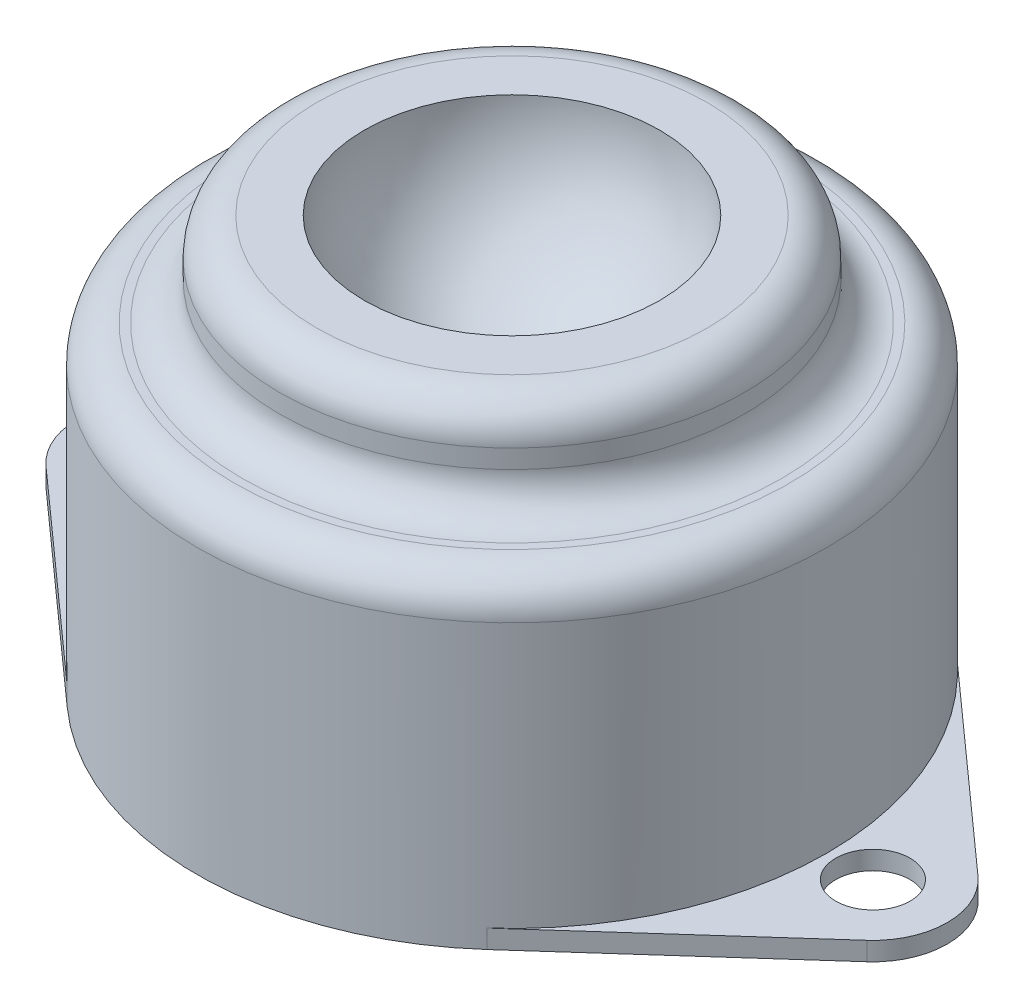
from build123d import *
from build123d.topology import SkipClean

# Parameters (mm, degrees)
SKETCH1_R           = 2
SKETCH1_R_2         = 16.933333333
BOSS_EXTRUDE1_DEPTH = 1
SKETCH2_R           = 16.933333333
BOSS_EXTRUDE2_DEPTH = 21.225
CUT_REVOLVE2_ANGLE  = 180
CUT_EXTRUDE2_START  = -5
SKETCH4_R           = 16.933333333
SKETCH4_R_2         = 12.5
CUT_EXTRUDE2_DEPTH  = 5
FILLET1_R           = 2


with BuildPart() as part:
    # Sketch1 → Boss-Extrude1 (new body)
    # profile 1 of 3: a face of its own
    with BuildSketch(Plane(origin=(0, 0, 0), x_dir=(1, 0, 0), z_dir=(0, 1, 0))):
        with BuildLine():
            ThreePointArc((-11.288888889, -12.621361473), (-16.933333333, 0), (-11.288888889, 12.621361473))
            Line((-11.288888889, 12.621361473), (-22.066666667, 2.98142397))
            ThreePointArc((-22.066666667, 2.98142397), (-23.4, 0), (-22.066666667, -2.98142397))
            Line((-22.066666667, -2.98142397), (-11.288888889, -12.621361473))
        make_face()
        with Locations(Location((-19.4, 0, 0), (0, 0, 270))):
            Circle(SKETCH1_R, mode=Mode.SUBTRACT)
    # profile 2 of 3: a face of its own
    with BuildSketch(Plane(origin=(0, 0, 0), x_dir=(1, 0, 0), z_dir=(0, 1, 0))):
        Circle(SKETCH1_R_2)
    # profile 3 of 3: a face of its own
    with BuildSketch(Plane(origin=(0, 0, 0), x_dir=(1, 0, 0), z_dir=(0, 1, 0))):
        with BuildLine():
            Line((22.066666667, 2.98142397), (11.288888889, 12.621361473))
            ThreePointArc((11.288888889, 12.621361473), (15.457947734, 6.913004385), (16.933333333, 0))
            ThreePointArc((16.933333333, 0), (15.457947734, -6.913004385), (11.288888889, -12.621361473))
            Line((11.288888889, -12.621361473), (22.066666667, -2.98142397))
            ThreePointArc((22.066666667, -2.98142397), (23.4, 0), (22.066666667, 2.98142397))
        make_face()
        with Locations(Location((19.4, 0, 0), (0, 0, 270))):
            Circle(SKETCH1_R, mode=Mode.SUBTRACT)
    extrude(amount=BOSS_EXTRUDE1_DEPTH)

    # Sketch2 → Boss-Extrude2 (add)
    with BuildSketch(Plane(origin=(0, 1, 0), x_dir=(1, 0, 0), z_dir=(0, 1, 0))):
        with Locations(Location((0, 0, 0), (0, 0, 48.189685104))):
            Circle(SKETCH2_R)
    extrude(amount=BOSS_EXTRUDE2_DEPTH)

    # Sketch3 → Cut-Revolve2 (revolve, cut)
    with SkipClean():  # the faces are left unmerged after this step: merging them gives an invalid solid
        with BuildSketch(Plane(origin=(0, 22.225, 0), x_dir=(1, 0, 0), z_dir=(0, 1, 0))):
            with BuildLine():
                Line((0, 7.9375), (0, -7.9375))
                ThreePointArc((0, -7.9375), (-7.9375, 0), (0, 7.9375))
            make_face()
        revolve(axis=Axis((0, 22.225, -7.9375), (0, 0, 1)), revolution_arc=CUT_REVOLVE2_ANGLE, mode=Mode.SUBTRACT)

    # Sketch4 → Cut-Extrude2 (cut)
    with BuildSketch(Plane(origin=(0, 22.225, 0), x_dir=(1, 0, 0), z_dir=(0, 1, 0)).offset(CUT_EXTRUDE2_START)):
        with Locations(Location((0, 0, 0), (0, 0, 48.189685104))):
            Circle(SKETCH4_R)
        with Locations(Location((0, 0, 0), (0, 0, 270))):
            Circle(SKETCH4_R_2, mode=Mode.SUBTRACT)
    extrude(amount=CUT_EXTRUDE2_DEPTH, mode=Mode.SUBTRACT)

    # Fillet1
    fillet1_edges = [part.edges().sort_by_distance(p)[0] for p in [
        (-11.288888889, 17.225, 12.621361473),
        (0, 17.225, -12.5),
        (0, 22.225, -12.5),
    ]]
    fillet(fillet1_edges, radius=FILLET1_R)


solid = part.part
